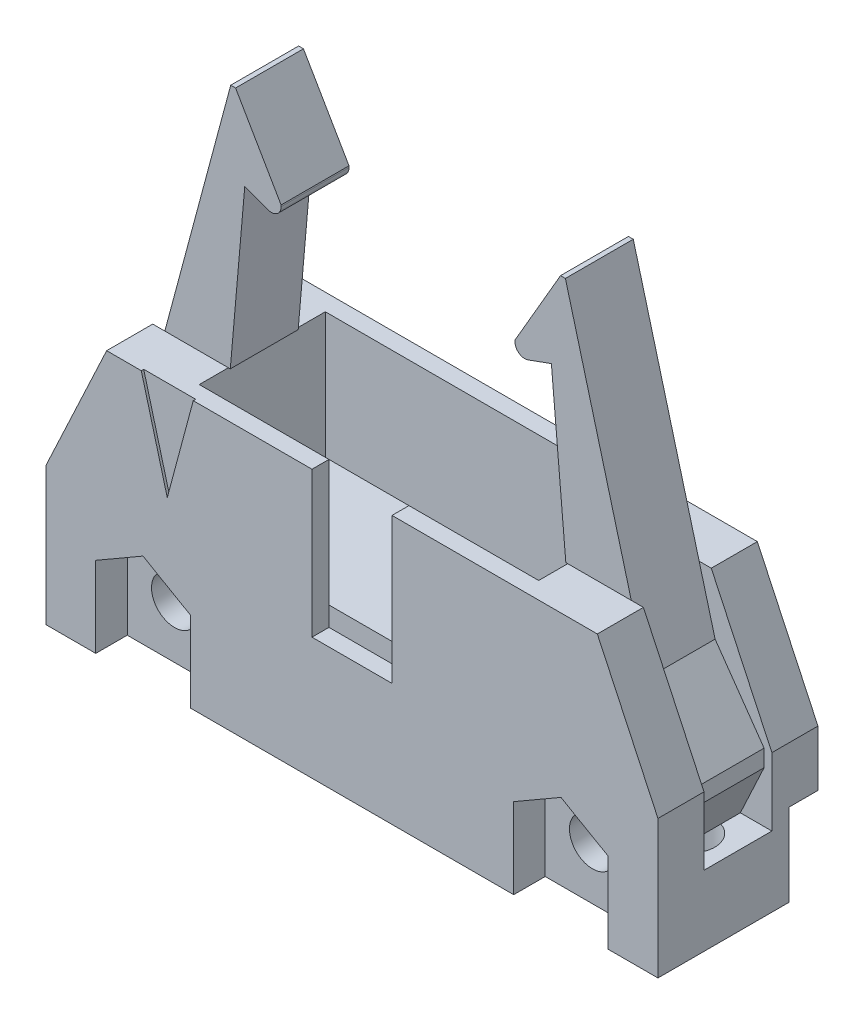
from build123d import *

# Parameters (mm, degrees)
SKETCH1_W                = 32.0548
SKETCH1_H                = 14.0208
BASE_EXTRUDE_DEPTH       = 8.382
ANGLE_CUT_OUTSIDE_DEPTH  = 36.977089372
SKETCH3_W                = 17.78
SKETCH3_H                = 6.604
INSIDE_CUT1_DEPTH        = 6.604
SKETCH4_W                = 4.191
SKETCH4_H                = 7.62
CENTER_CUT1_DEPTH        = 0.889
LATCHES_DEPTH            = 3.556
LATCH_CUT1_DEPTH         = 3.556
PIN_1_TRIANGLE_CUT_DEPTH = 0.127
SCREW_RECESS_DEPTH       = 1.651
SKETCH12_R               = 1.2065
SCREW_HOLE_DEPTH         = 43.678502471
SKETCH13_R               = 1.27
VERT_MNT_HOLE_DEPTH      = 3.683
SKETCH15_W               = 34.544
SKETCH15_H               = 4.318
R_ANG_REAR_CUT1_DEPTH    = 1.524


with BuildPart() as part:
    # Sketch1 → Base-Extrude (new body)
    with BuildSketch(Plane.XY):
        with Locations((16.0274, 7.0104)):
            Rectangle(SKETCH1_W, SKETCH1_H)
    extrude(amount=-BASE_EXTRUDE_DEPTH)

    # Sketch2 → Angle Cut Outside (cut, through all)
    with BuildSketch(Plane.XY):
        Polygon((3.175, 14.0208), (0, 7.239), (0, 14.0208), align=None)
        Polygon((32.0548, 14.0208), (28.8798, 14.0208), (32.0548, 7.239), align=None)
    extrude(amount=-ANGLE_CUT_OUTSIDE_DEPTH, mode=Mode.SUBTRACT)

    # Sketch3 → Inside Cut1 (cut)
    with BuildSketch(Plane(origin=(0, 14.0208, 0), x_dir=(-1, 0, 0), z_dir=(0, 1, 0))):
        with Locations((-16.0274, -4.191)):
            Rectangle(SKETCH3_W, SKETCH3_H)
    extrude(amount=-INSIDE_CUT1_DEPTH, mode=Mode.SUBTRACT)

    # Sketch4 → Center Cut1 (cut)
    with BuildSketch(Plane.XY):
        with Locations((16.0274, 10.2108)):
            Rectangle(SKETCH4_W, SKETCH4_H)
    extrude(amount=-CENTER_CUT1_DEPTH, mode=Mode.SUBTRACT)

    # Sketch7 → Latches (add)
    with BuildSketch(Plane.XY.offset(-2.413)):
        with BuildLine():
            Line((24.059073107, 22.67022796), (24.8158, 14.0208))
            Line((24.8158, 14.0208), (28.2448, 14.0208))
            Line((28.2448, 14.0208), (24.793448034, 26.901420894))
            Line((24.793448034, 26.901420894), (24.539448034, 26.901420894))
            Line((24.539448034, 26.901420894), (22.154073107, 22.787768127))
            Line((22.154073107, 22.787768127), (22.154073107, 22.702363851))
            ThreePointArc((22.154073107, 22.702363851), (22.370696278, 22.286234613), (22.83581934, 22.225))
            Line((22.83581934, 22.225), (24.059073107, 22.67022796))
        make_face()
        with BuildLine():
            Line((7.239, 14.0208), (3.81, 14.0208))
            Line((3.81, 14.0208), (7.261351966, 26.901420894))
            Line((7.261351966, 26.901420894), (7.515351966, 26.901420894))
            Line((7.515351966, 26.901420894), (9.900726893, 22.787768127))
            Line((9.900726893, 22.787768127), (9.900726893, 22.702363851))
            ThreePointArc((9.900726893, 22.702363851), (9.684103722, 22.286234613), (9.21898066, 22.225))
            Line((9.21898066, 22.225), (7.995726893, 22.67022796))
            Line((7.995726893, 22.67022796), (7.239, 14.0208))
        make_face()
    extrude(amount=-LATCHES_DEPTH)

    # Sketch8 → Latch Cut1 (cut)
    with BuildSketch(Plane.XY.offset(-2.413)):
        Polygon((3.81, 14.0208), (2.974670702, 10.903308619), (0.408894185, 7.239), (0.408894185, 6.35), (1.652536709, 3.683), (0, 3.683), (0, 7.239), (3.175, 14.0208), align=None)
        Polygon((28.2448, 14.0208), (28.8798, 14.0208), (32.0548, 7.239), (32.0548, 3.683), (30.402263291, 3.683), (31.645905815, 6.35), (31.645905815, 7.239), (29.080129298, 10.903308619), align=None)
    extrude(amount=-LATCH_CUT1_DEPTH, mode=Mode.SUBTRACT)

    # Sketch9 → Pin 1 Triangle Cut (cut)
    with BuildSketch(Plane.XY):
        Polygon((4.988818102, 14.0208), (6.35, 8.9408), (7.711181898, 14.0208), align=None)
    extrude(amount=-PIN_1_TRIANGLE_CUT_DEPTH, mode=Mode.SUBTRACT)

    # Sketch10 → Screw Recess (cut)
    with BuildSketch(Plane.XY):
        Polygon((7.5565, 0), (7.5565, 4.223807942), (5.08, 5.653615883), (2.6035, 4.223807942), (2.6035, 0), align=None)
        Polygon((29.4513, 0), (24.4983, 0), (24.4983, 4.223807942), (26.9748, 5.653615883), (29.4513, 4.223807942), align=None)
    extrude(amount=-SCREW_RECESS_DEPTH, mode=Mode.SUBTRACT)

    # Sketch12 → Screw Hole (cut, through all)
    with BuildSketch(Plane.XY):
        with Locations((5.08, 2.794)):
            Circle(SKETCH12_R)
        with Locations(Location((26.9748, 2.794, 0), (0, 0, 180))):
            Circle(SKETCH12_R)
    extrude(amount=-SCREW_HOLE_DEPTH, mode=Mode.SUBTRACT)

    # Sketch13 → Vert Mnt Hole (cut)
    with BuildSketch(Plane.XZ):
        with Locations(Location((2.032, -3.7338, 0), (0, 0, 270))):
            Circle(SKETCH13_R)
        with Locations(Location((30.0228, -3.7338, 0), (0, 0, 287.384941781))):
            Circle(SKETCH13_R)
    extrude(amount=-VERT_MNT_HOLE_DEPTH, mode=Mode.SUBTRACT)

    # Sketch15 → R Ang Rear Cut1 (cut)
    with BuildSketch(Plane(origin=(0, 0, -8.382), x_dir=(-1, 0, 0), z_dir=(0, 0, -1))):
        with Locations((-16.0274, 2.159)):
            Rectangle(SKETCH15_W, SKETCH15_H)
    extrude(amount=-R_ANG_REAR_CUT1_DEPTH, mode=Mode.SUBTRACT)


solid = part.part
